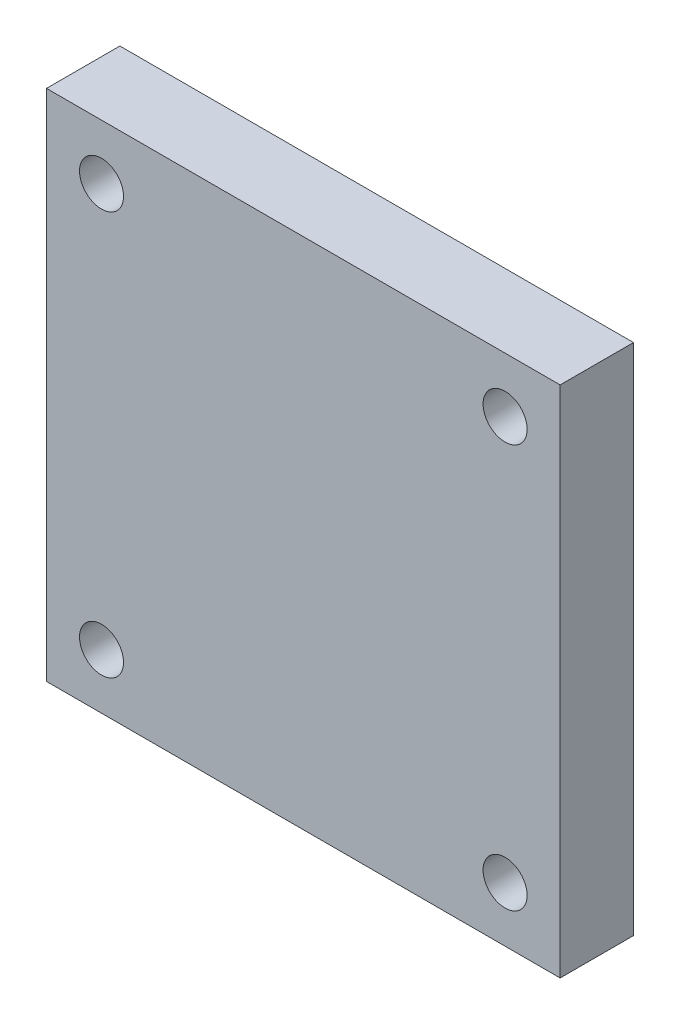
ISO-10303-21;
HEADER;
FILE_DESCRIPTION(('STEP AP214'),'2;1');
FILE_NAME('part.step','',(''),(''),'','','');
FILE_SCHEMA(('AUTOMOTIVE_DESIGN { 1 0 10303 214 1 1 1 1 }'));
ENDSEC;
DATA;
#1=APPLICATION_CONTEXT('core data for automotive mechanical design processes');
#2=APPLICATION_PROTOCOL_DEFINITION('international standard','automotive_design',2000,#1);
#3=PRODUCT_CONTEXT('',#1,'mechanical');
#4=PRODUCT('Part','Part','',(#3));
#5=PRODUCT_RELATED_PRODUCT_CATEGORY('part','',(#4));
#6=PRODUCT_DEFINITION_FORMATION('','',#4);
#7=PRODUCT_DEFINITION_CONTEXT('part definition',#1,'design');
#8=PRODUCT_DEFINITION('design','',#6,#7);
#9=PRODUCT_DEFINITION_SHAPE('','',#8);
#10=(LENGTH_UNIT() NAMED_UNIT(*) SI_UNIT(.MILLI.,.METRE.));
#11=(NAMED_UNIT(*) PLANE_ANGLE_UNIT() SI_UNIT($,.RADIAN.));
#12=(NAMED_UNIT(*) SI_UNIT($,.STERADIAN.) SOLID_ANGLE_UNIT());
#13=UNCERTAINTY_MEASURE_WITH_UNIT(LENGTH_MEASURE(1.E-05),#10,'distance_accuracy_value','');
#14=(GEOMETRIC_REPRESENTATION_CONTEXT(3) GLOBAL_UNCERTAINTY_ASSIGNED_CONTEXT((#13)) GLOBAL_UNIT_ASSIGNED_CONTEXT((#10,
#11,#12)) REPRESENTATION_CONTEXT('',''));
#15=CARTESIAN_POINT('',(0.,0.,0.));
#16=DIRECTION('',(0.,0.,1.));
#17=DIRECTION('',(1.,0.,0.));
#18=AXIS2_PLACEMENT_3D('',#15,#16,#17);
#19=CARTESIAN_POINT('',(-70.,-70.,20.));
#20=DIRECTION('',(0.,0.,1.));
#21=DIRECTION('',(1.,0.,0.));
#22=AXIS2_PLACEMENT_3D('',#19,#20,#21);
#23=PLANE('',#22);
#24=CARTESIAN_POINT('',(55.,-55.,20.));
#25=DIRECTION('',(0.,0.,1.));
#26=DIRECTION('',(-1.,0.,0.));
#27=AXIS2_PLACEMENT_3D('',#24,#25,#26);
#28=CIRCLE('',#27,6.);
#29=CARTESIAN_POINT('',(49.,-55.,20.));
#30=VERTEX_POINT('',#29);
#31=EDGE_CURVE('E126',#30,#30,#28,.T.);
#32=ORIENTED_EDGE('',*,*,#31,.F.);
#33=EDGE_LOOP('',(#32));
#34=FACE_BOUND('',#33,.T.);
#35=CARTESIAN_POINT('',(-55.,55.,20.));
#36=DIRECTION('',(0.,0.,1.));
#37=DIRECTION('',(1.,0.,0.));
#38=AXIS2_PLACEMENT_3D('',#35,#36,#37);
#39=CIRCLE('',#38,6.);
#40=CARTESIAN_POINT('',(-49.,55.,20.));
#41=VERTEX_POINT('',#40);
#42=EDGE_CURVE('E105',#41,#41,#39,.T.);
#43=ORIENTED_EDGE('',*,*,#42,.F.);
#44=EDGE_LOOP('',(#43));
#45=FACE_BOUND('',#44,.T.);
#46=DIRECTION('',(0.,-1.,0.));
#47=VECTOR('',#46,1.);
#48=CARTESIAN_POINT('',(-70.,70.,20.));
#49=LINE('',#48,#47);
#50=CARTESIAN_POINT('',(-70.,70.,20.));
#51=VERTEX_POINT('',#50);
#52=CARTESIAN_POINT('',(-70.,-70.,20.));
#53=VERTEX_POINT('',#52);
#54=EDGE_CURVE('E90',#51,#53,#49,.T.);
#55=ORIENTED_EDGE('',*,*,#54,.T.);
#56=DIRECTION('',(1.,0.,0.));
#57=VECTOR('',#56,1.);
#58=CARTESIAN_POINT('',(-70.,-70.,20.));
#59=LINE('',#58,#57);
#60=CARTESIAN_POINT('',(70.,-70.,20.));
#61=VERTEX_POINT('',#60);
#62=EDGE_CURVE('E85',#53,#61,#59,.T.);
#63=ORIENTED_EDGE('',*,*,#62,.T.);
#64=DIRECTION('',(0.,1.,0.));
#65=VECTOR('',#64,1.);
#66=CARTESIAN_POINT('',(70.,70.,20.));
#67=LINE('',#66,#65);
#68=CARTESIAN_POINT('',(70.,70.,20.));
#69=VERTEX_POINT('',#68);
#70=EDGE_CURVE('E88',#61,#69,#67,.T.);
#71=ORIENTED_EDGE('',*,*,#70,.T.);
#72=DIRECTION('',(-1.,0.,0.));
#73=VECTOR('',#72,1.);
#74=CARTESIAN_POINT('',(-70.,70.,20.));
#75=LINE('',#74,#73);
#76=EDGE_CURVE('E55',#69,#51,#75,.T.);
#77=ORIENTED_EDGE('',*,*,#76,.T.);
#78=EDGE_LOOP('',(#55,#63,#71,#77));
#79=FACE_BOUND('',#78,.T.);
#80=CARTESIAN_POINT('',(-55.,-55.,20.));
#81=DIRECTION('',(0.,0.,1.));
#82=DIRECTION('',(1.,0.,0.));
#83=AXIS2_PLACEMENT_3D('',#80,#81,#82);
#84=CIRCLE('',#83,6.);
#85=CARTESIAN_POINT('',(-49.,-55.,20.));
#86=VERTEX_POINT('',#85);
#87=EDGE_CURVE('E120',#86,#86,#84,.T.);
#88=ORIENTED_EDGE('',*,*,#87,.F.);
#89=EDGE_LOOP('',(#88));
#90=FACE_BOUND('',#89,.T.);
#91=CARTESIAN_POINT('',(55.,55.,20.));
#92=DIRECTION('',(0.,0.,1.));
#93=DIRECTION('',(-1.,0.,0.));
#94=AXIS2_PLACEMENT_3D('',#91,#92,#93);
#95=CIRCLE('',#94,6.);
#96=CARTESIAN_POINT('',(49.,55.,20.));
#97=VERTEX_POINT('',#96);
#98=EDGE_CURVE('E132',#97,#97,#95,.T.);
#99=ORIENTED_EDGE('',*,*,#98,.F.);
#100=EDGE_LOOP('',(#99));
#101=FACE_BOUND('',#100,.T.);
#102=ADVANCED_FACE('F38',(#34,#45,#79,#90,#101),#23,.T.);
#103=CARTESIAN_POINT('',(-70.,-70.,0.));
#104=DIRECTION('',(0.,0.,1.));
#105=DIRECTION('',(1.,0.,0.));
#106=AXIS2_PLACEMENT_3D('',#103,#104,#105);
#107=PLANE('',#106);
#108=CARTESIAN_POINT('',(55.,-55.,0.));
#109=DIRECTION('',(0.,0.,1.));
#110=DIRECTION('',(-1.,0.,0.));
#111=AXIS2_PLACEMENT_3D('',#108,#109,#110);
#112=CIRCLE('',#111,6.);
#113=CARTESIAN_POINT('',(49.,-55.,0.));
#114=VERTEX_POINT('',#113);
#115=EDGE_CURVE('E129',#114,#114,#112,.T.);
#116=ORIENTED_EDGE('',*,*,#115,.T.);
#117=EDGE_LOOP('',(#116));
#118=FACE_BOUND('',#117,.T.);
#119=CARTESIAN_POINT('',(-55.,55.,0.));
#120=DIRECTION('',(0.,0.,1.));
#121=DIRECTION('',(1.,0.,0.));
#122=AXIS2_PLACEMENT_3D('',#119,#120,#121);
#123=CIRCLE('',#122,6.);
#124=CARTESIAN_POINT('',(-49.,55.,0.));
#125=VERTEX_POINT('',#124);
#126=EDGE_CURVE('E117',#125,#125,#123,.T.);
#127=ORIENTED_EDGE('',*,*,#126,.T.);
#128=EDGE_LOOP('',(#127));
#129=FACE_BOUND('',#128,.T.);
#130=DIRECTION('',(0.,-1.,0.));
#131=VECTOR('',#130,1.);
#132=CARTESIAN_POINT('',(-70.,70.,0.));
#133=LINE('',#132,#131);
#134=CARTESIAN_POINT('',(-70.,70.,0.));
#135=VERTEX_POINT('',#134);
#136=CARTESIAN_POINT('',(-70.,-70.,0.));
#137=VERTEX_POINT('',#136);
#138=EDGE_CURVE('E102',#135,#137,#133,.T.);
#139=ORIENTED_EDGE('',*,*,#138,.F.);
#140=DIRECTION('',(-1.,0.,0.));
#141=VECTOR('',#140,1.);
#142=CARTESIAN_POINT('',(-70.,70.,0.));
#143=LINE('',#142,#141);
#144=CARTESIAN_POINT('',(70.,70.,0.));
#145=VERTEX_POINT('',#144);
#146=EDGE_CURVE('E78',#145,#135,#143,.T.);
#147=ORIENTED_EDGE('',*,*,#146,.F.);
#148=DIRECTION('',(0.,1.,0.));
#149=VECTOR('',#148,1.);
#150=CARTESIAN_POINT('',(70.,70.,0.));
#151=LINE('',#150,#149);
#152=CARTESIAN_POINT('',(70.,-70.,0.));
#153=VERTEX_POINT('',#152);
#154=EDGE_CURVE('E72',#153,#145,#151,.T.);
#155=ORIENTED_EDGE('',*,*,#154,.F.);
#156=DIRECTION('',(1.,0.,0.));
#157=VECTOR('',#156,1.);
#158=CARTESIAN_POINT('',(-70.,-70.,0.));
#159=LINE('',#158,#157);
#160=EDGE_CURVE('E94',#137,#153,#159,.T.);
#161=ORIENTED_EDGE('',*,*,#160,.F.);
#162=EDGE_LOOP('',(#139,#147,#155,#161));
#163=FACE_BOUND('',#162,.T.);
#164=CARTESIAN_POINT('',(-55.,-55.,0.));
#165=DIRECTION('',(0.,0.,1.));
#166=DIRECTION('',(1.,0.,0.));
#167=AXIS2_PLACEMENT_3D('',#164,#165,#166);
#168=CIRCLE('',#167,6.);
#169=CARTESIAN_POINT('',(-49.,-55.,0.));
#170=VERTEX_POINT('',#169);
#171=EDGE_CURVE('E123',#170,#170,#168,.T.);
#172=ORIENTED_EDGE('',*,*,#171,.T.);
#173=EDGE_LOOP('',(#172));
#174=FACE_BOUND('',#173,.T.);
#175=CARTESIAN_POINT('',(55.,55.,0.));
#176=DIRECTION('',(0.,0.,1.));
#177=DIRECTION('',(-1.,0.,0.));
#178=AXIS2_PLACEMENT_3D('',#175,#176,#177);
#179=CIRCLE('',#178,6.);
#180=CARTESIAN_POINT('',(49.,55.,0.));
#181=VERTEX_POINT('',#180);
#182=EDGE_CURVE('E135',#181,#181,#179,.T.);
#183=ORIENTED_EDGE('',*,*,#182,.T.);
#184=EDGE_LOOP('',(#183));
#185=FACE_BOUND('',#184,.T.);
#186=ADVANCED_FACE('F113',(#118,#129,#163,#174,#185),#107,.F.);
#187=CARTESIAN_POINT('',(-70.,70.,20.));
#188=DIRECTION('',(1.,0.,0.));
#189=DIRECTION('',(0.,1.,0.));
#190=AXIS2_PLACEMENT_3D('',#187,#188,#189);
#191=PLANE('',#190);
#192=ORIENTED_EDGE('',*,*,#138,.T.);
#193=DIRECTION('',(0.,0.,-1.));
#194=VECTOR('',#193,1.);
#195=CARTESIAN_POINT('',(-70.,-70.,20.));
#196=LINE('',#195,#194);
#197=EDGE_CURVE('E11',#53,#137,#196,.T.);
#198=ORIENTED_EDGE('',*,*,#197,.F.);
#199=ORIENTED_EDGE('',*,*,#54,.F.);
#200=DIRECTION('',(0.,0.,-1.));
#201=VECTOR('',#200,1.);
#202=CARTESIAN_POINT('',(-70.,70.,20.));
#203=LINE('',#202,#201);
#204=EDGE_CURVE('E98',#51,#135,#203,.T.);
#205=ORIENTED_EDGE('',*,*,#204,.T.);
#206=EDGE_LOOP('',(#192,#198,#199,#205));
#207=FACE_BOUND('',#206,.T.);
#208=ADVANCED_FACE('F40',(#207),#191,.F.);
#209=CARTESIAN_POINT('',(-70.,-70.,20.));
#210=DIRECTION('',(0.,1.,0.));
#211=DIRECTION('',(0.,0.,1.));
#212=AXIS2_PLACEMENT_3D('',#209,#210,#211);
#213=PLANE('',#212);
#214=ORIENTED_EDGE('',*,*,#160,.T.);
#215=DIRECTION('',(0.,0.,-1.));
#216=VECTOR('',#215,1.);
#217=CARTESIAN_POINT('',(70.,-70.,20.));
#218=LINE('',#217,#216);
#219=EDGE_CURVE('E47',#61,#153,#218,.T.);
#220=ORIENTED_EDGE('',*,*,#219,.F.);
#221=ORIENTED_EDGE('',*,*,#62,.F.);
#222=ORIENTED_EDGE('',*,*,#197,.T.);
#223=EDGE_LOOP('',(#214,#220,#221,#222));
#224=FACE_BOUND('',#223,.T.);
#225=ADVANCED_FACE('F93',(#224),#213,.F.);
#226=CARTESIAN_POINT('',(70.,70.,20.));
#227=DIRECTION('',(-1.,0.,0.));
#228=DIRECTION('',(0.,-1.,0.));
#229=AXIS2_PLACEMENT_3D('',#226,#227,#228);
#230=PLANE('',#229);
#231=ORIENTED_EDGE('',*,*,#154,.T.);
#232=DIRECTION('',(0.,0.,-1.));
#233=VECTOR('',#232,1.);
#234=CARTESIAN_POINT('',(70.,70.,20.));
#235=LINE('',#234,#233);
#236=EDGE_CURVE('E95',#69,#145,#235,.T.);
#237=ORIENTED_EDGE('',*,*,#236,.F.);
#238=ORIENTED_EDGE('',*,*,#70,.F.);
#239=ORIENTED_EDGE('',*,*,#219,.T.);
#240=EDGE_LOOP('',(#231,#237,#238,#239));
#241=FACE_BOUND('',#240,.T.);
#242=ADVANCED_FACE('F96',(#241),#230,.F.);
#243=CARTESIAN_POINT('',(-70.,70.,20.));
#244=DIRECTION('',(0.,-1.,0.));
#245=DIRECTION('',(0.,0.,-1.));
#246=AXIS2_PLACEMENT_3D('',#243,#244,#245);
#247=PLANE('',#246);
#248=ORIENTED_EDGE('',*,*,#146,.T.);
#249=ORIENTED_EDGE('',*,*,#204,.F.);
#250=ORIENTED_EDGE('',*,*,#76,.F.);
#251=ORIENTED_EDGE('',*,*,#236,.T.);
#252=EDGE_LOOP('',(#248,#249,#250,#251));
#253=FACE_BOUND('',#252,.T.);
#254=ADVANCED_FACE('F110',(#253),#247,.F.);
#255=CARTESIAN_POINT('',(-55.,55.,20.));
#256=DIRECTION('',(0.,0.,-1.));
#257=DIRECTION('',(-1.,0.,0.));
#258=AXIS2_PLACEMENT_3D('',#255,#256,#257);
#259=CYLINDRICAL_SURFACE('',#258,6.);
#260=ORIENTED_EDGE('',*,*,#42,.T.);
#261=EDGE_LOOP('',(#260));
#262=FACE_BOUND('',#261,.T.);
#263=ORIENTED_EDGE('',*,*,#126,.F.);
#264=EDGE_LOOP('',(#263));
#265=FACE_BOUND('',#264,.T.);
#266=ADVANCED_FACE('F155',(#262,#265),#259,.F.);
#267=CARTESIAN_POINT('',(-55.,-55.,20.));
#268=DIRECTION('',(0.,0.,-1.));
#269=DIRECTION('',(-1.,0.,0.));
#270=AXIS2_PLACEMENT_3D('',#267,#268,#269);
#271=CYLINDRICAL_SURFACE('',#270,6.);
#272=ORIENTED_EDGE('',*,*,#87,.T.);
#273=EDGE_LOOP('',(#272));
#274=FACE_BOUND('',#273,.T.);
#275=ORIENTED_EDGE('',*,*,#171,.F.);
#276=EDGE_LOOP('',(#275));
#277=FACE_BOUND('',#276,.T.);
#278=ADVANCED_FACE('F201',(#274,#277),#271,.F.);
#279=CARTESIAN_POINT('',(55.,-55.,20.));
#280=DIRECTION('',(0.,0.,-1.));
#281=DIRECTION('',(-1.,0.,0.));
#282=AXIS2_PLACEMENT_3D('',#279,#280,#281);
#283=CYLINDRICAL_SURFACE('',#282,6.);
#284=ORIENTED_EDGE('',*,*,#31,.T.);
#285=EDGE_LOOP('',(#284));
#286=FACE_BOUND('',#285,.T.);
#287=ORIENTED_EDGE('',*,*,#115,.F.);
#288=EDGE_LOOP('',(#287));
#289=FACE_BOUND('',#288,.T.);
#290=ADVANCED_FACE('F209',(#286,#289),#283,.F.);
#291=CARTESIAN_POINT('',(55.,55.,20.));
#292=DIRECTION('',(0.,0.,-1.));
#293=DIRECTION('',(-1.,0.,0.));
#294=AXIS2_PLACEMENT_3D('',#291,#292,#293);
#295=CYLINDRICAL_SURFACE('',#294,6.);
#296=ORIENTED_EDGE('',*,*,#98,.T.);
#297=EDGE_LOOP('',(#296));
#298=FACE_BOUND('',#297,.T.);
#299=ORIENTED_EDGE('',*,*,#182,.F.);
#300=EDGE_LOOP('',(#299));
#301=FACE_BOUND('',#300,.T.);
#302=ADVANCED_FACE('F141',(#298,#301),#295,.F.);
#303=CLOSED_SHELL('',(#102,#186,#208,#225,#242,#254,#266,#278,#290,#302));
#304=MANIFOLD_SOLID_BREP('B2',#303);
#305=ADVANCED_BREP_SHAPE_REPRESENTATION('',(#18,#304),#14);
#306=SHAPE_DEFINITION_REPRESENTATION(#9,#305);
ENDSEC;
END-ISO-10303-21;
